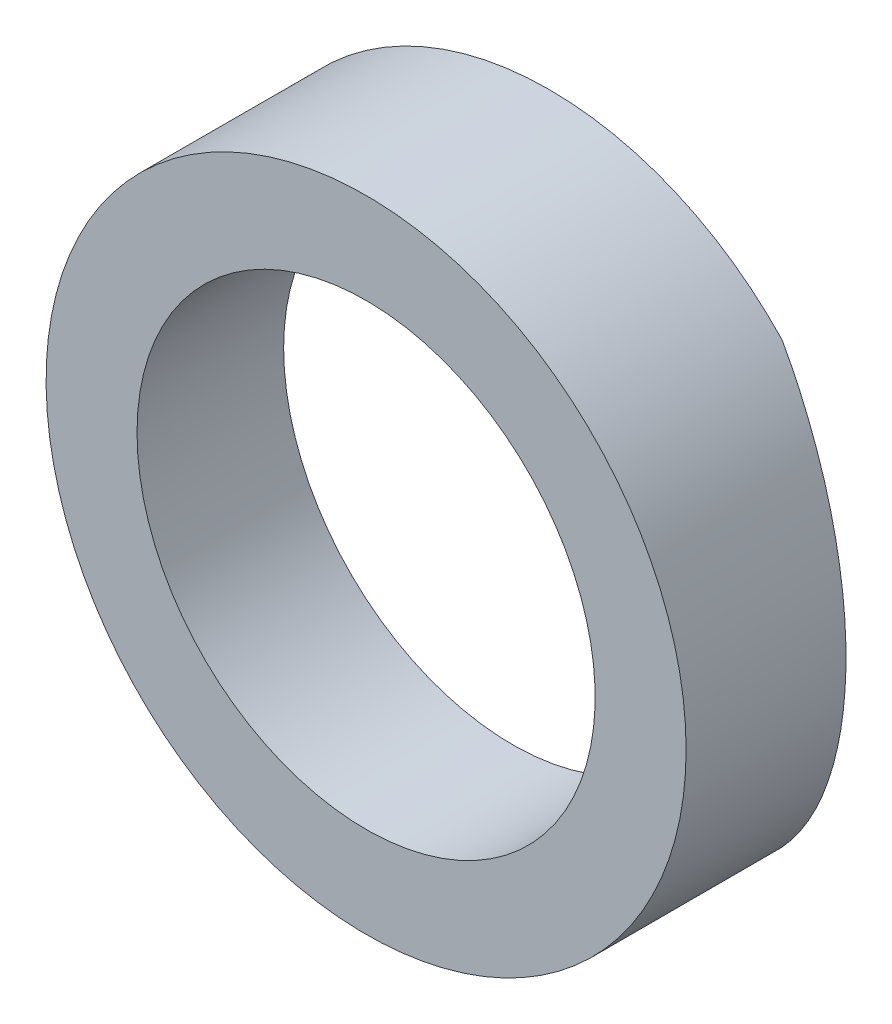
from build123d import *

# Parameters (mm, degrees)
SKETCH1_R               = 34.925
BOSS_EXTRUDE1_DEPTH     = 20
SKETCH2_R               = 25
CUT_EXTRUDE1_DEPTH      = 54.287064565
SKETCH3_R               = 31.75
CUT_EXTRUDE2_DEPTH      = 4
CUT_EXTRUDE3_DEPTH      = 54.287064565
CUT_EXTRUDE3_DEPTH_BACK = 54.287064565


with BuildPart() as part:
    # Sketch1 → Boss-Extrude1 (new body)
    with BuildSketch(Plane.XY):
        Circle(SKETCH1_R)
    extrude(amount=BOSS_EXTRUDE1_DEPTH)

    # Sketch2 → Cut-Extrude1 (cut, through all)
    with BuildSketch(Plane(origin=(0, 0, 0), x_dir=(-1, 0, 0), z_dir=(0, 0, -1))):
        Circle(SKETCH2_R)
    extrude(amount=-CUT_EXTRUDE1_DEPTH, mode=Mode.SUBTRACT)

    # Sketch3 → Cut-Extrude2 (cut)
    with BuildSketch(Plane(origin=(0, 0, 0), x_dir=(-1, 0, 0), z_dir=(0, 0, -1))):
        Circle(SKETCH3_R)
    extrude(amount=-CUT_EXTRUDE2_DEPTH, mode=Mode.SUBTRACT)

    # Sketch4 → Cut-Extrude3 (cut, two sides: drawn at the far end of the back side and taken through both)
    with BuildSketch(Plane(origin=(0, 0, 0), x_dir=(1, 0, 0), z_dir=(0, 1, 0)).offset(-CUT_EXTRUDE3_DEPTH_BACK)):
        Polygon((-54.672257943, -7.843477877), (-25.4, 0), (-54.672257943, 4.628694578), align=None)
        Polygon((54.672257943, 4.628694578), (54.672257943, -7.843477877), (25.4, 0), align=None)
    extrude(amount=CUT_EXTRUDE3_DEPTH + CUT_EXTRUDE3_DEPTH_BACK, mode=Mode.SUBTRACT)


solid = part.part
